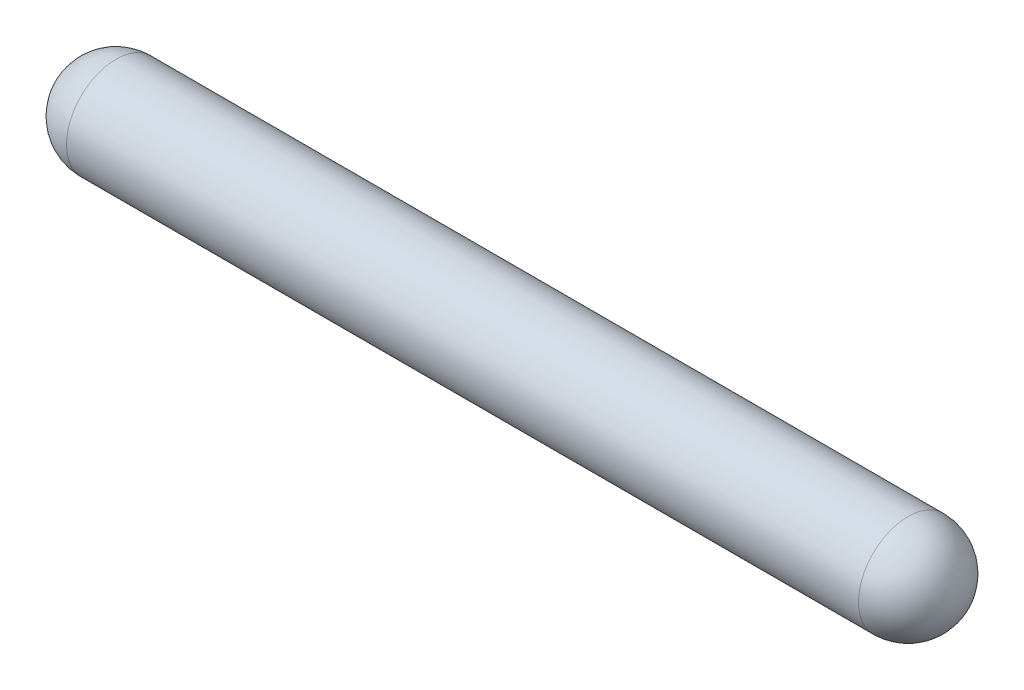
ISO-10303-21;
HEADER;
FILE_DESCRIPTION(('STEP AP214'),'2;1');
FILE_NAME('part.step','',(''),(''),'','','');
FILE_SCHEMA(('AUTOMOTIVE_DESIGN { 1 0 10303 214 1 1 1 1 }'));
ENDSEC;
DATA;
#1=APPLICATION_CONTEXT('core data for automotive mechanical design processes');
#2=APPLICATION_PROTOCOL_DEFINITION('international standard','automotive_design',2000,#1);
#3=PRODUCT_CONTEXT('',#1,'mechanical');
#4=PRODUCT('Part','Part','',(#3));
#5=PRODUCT_RELATED_PRODUCT_CATEGORY('part','',(#4));
#6=PRODUCT_DEFINITION_FORMATION('','',#4);
#7=PRODUCT_DEFINITION_CONTEXT('part definition',#1,'design');
#8=PRODUCT_DEFINITION('design','',#6,#7);
#9=PRODUCT_DEFINITION_SHAPE('','',#8);
#10=(LENGTH_UNIT() NAMED_UNIT(*) SI_UNIT(.MILLI.,.METRE.));
#11=(NAMED_UNIT(*) PLANE_ANGLE_UNIT() SI_UNIT($,.RADIAN.));
#12=(NAMED_UNIT(*) SI_UNIT($,.STERADIAN.) SOLID_ANGLE_UNIT());
#13=UNCERTAINTY_MEASURE_WITH_UNIT(LENGTH_MEASURE(1.E-05),#10,'distance_accuracy_value','');
#14=(GEOMETRIC_REPRESENTATION_CONTEXT(3) GLOBAL_UNCERTAINTY_ASSIGNED_CONTEXT((#13)) GLOBAL_UNIT_ASSIGNED_CONTEXT((#10,
#11,#12)) REPRESENTATION_CONTEXT('',''));
#15=CARTESIAN_POINT('',(0.,0.,0.));
#16=DIRECTION('',(0.,0.,1.));
#17=DIRECTION('',(1.,0.,0.));
#18=AXIS2_PLACEMENT_3D('',#15,#16,#17);
#19=CARTESIAN_POINT('',(20.,32.5,0.));
#20=DIRECTION('',(-1.,0.,0.));
#21=DIRECTION('',(0.,0.,-1.));
#22=AXIS2_PLACEMENT_3D('',#19,#20,#21);
#23=CYLINDRICAL_SURFACE('',#22,2.5);
#24=CARTESIAN_POINT('',(-20.,32.5,0.));
#25=DIRECTION('',(1.,0.,0.));
#26=DIRECTION('',(0.,1.,0.));
#27=AXIS2_PLACEMENT_3D('',#24,#25,#26);
#28=CIRCLE('',#27,2.5);
#29=CARTESIAN_POINT('',(-20.,32.5,-2.5));
#30=VERTEX_POINT('',#29);
#31=CARTESIAN_POINT('',(-20.,32.5,2.5));
#32=VERTEX_POINT('',#31);
#33=EDGE_CURVE('E11',#30,#32,#28,.T.);
#34=ORIENTED_EDGE('',*,*,#33,.T.);
#35=CARTESIAN_POINT('',(-20.,32.5,0.));
#36=DIRECTION('',(-1.,0.,0.));
#37=DIRECTION('',(0.,-1.,0.));
#38=AXIS2_PLACEMENT_3D('',#35,#36,#37);
#39=CIRCLE('',#38,2.5);
#40=EDGE_CURVE('E24',#30,#32,#39,.T.);
#41=ORIENTED_EDGE('',*,*,#40,.F.);
#42=EDGE_LOOP('',(#34,#41));
#43=FACE_BOUND('',#42,.T.);
#44=CARTESIAN_POINT('',(20.,32.5,0.));
#45=DIRECTION('',(1.,0.,0.));
#46=DIRECTION('',(0.,1.,0.));
#47=AXIS2_PLACEMENT_3D('',#44,#45,#46);
#48=CIRCLE('',#47,2.5);
#49=CARTESIAN_POINT('',(20.,32.5,-2.5));
#50=VERTEX_POINT('',#49);
#51=CARTESIAN_POINT('',(20.,32.5,2.5));
#52=VERTEX_POINT('',#51);
#53=EDGE_CURVE('E40',#50,#52,#48,.T.);
#54=ORIENTED_EDGE('',*,*,#53,.F.);
#55=CARTESIAN_POINT('',(20.,32.5,0.));
#56=DIRECTION('',(-1.,0.,0.));
#57=DIRECTION('',(0.,-1.,0.));
#58=AXIS2_PLACEMENT_3D('',#55,#56,#57);
#59=CIRCLE('',#58,2.5);
#60=EDGE_CURVE('E30',#50,#52,#59,.T.);
#61=ORIENTED_EDGE('',*,*,#60,.T.);
#62=EDGE_LOOP('',(#54,#61));
#63=FACE_BOUND('',#62,.T.);
#64=ADVANCED_FACE('F16',(#43,#63),#23,.T.);
#65=CARTESIAN_POINT('',(-20.,32.5,0.));
#66=DIRECTION('',(0.,0.,1.));
#67=DIRECTION('',(0.,1.,0.));
#68=AXIS2_PLACEMENT_3D('',#65,#66,#67);
#69=SPHERICAL_SURFACE('',#68,2.5);
#70=CARTESIAN_POINT('',(-20.,32.5,0.));
#71=DIRECTION('',(1.,0.,0.));
#72=DIRECTION('',(0.,1.,0.));
#73=AXIS2_PLACEMENT_3D('',#70,#71,#72);
#74=SPHERICAL_SURFACE('',#73,2.5);
#75=ORIENTED_EDGE('',*,*,#33,.F.);
#76=ORIENTED_EDGE('',*,*,#40,.T.);
#77=EDGE_LOOP('',(#75,#76));
#78=FACE_BOUND('',#77,.T.);
#79=ADVANCED_FACE('F62',(#78),#74,.T.);
#80=CARTESIAN_POINT('',(20.,32.5,0.));
#81=DIRECTION('',(0.,0.,1.));
#82=DIRECTION('',(0.,-1.,0.));
#83=AXIS2_PLACEMENT_3D('',#80,#81,#82);
#84=SPHERICAL_SURFACE('',#83,2.5);
#85=CARTESIAN_POINT('',(20.,32.5,0.));
#86=DIRECTION('',(-1.,0.,0.));
#87=DIRECTION('',(0.,-1.,0.));
#88=AXIS2_PLACEMENT_3D('',#85,#86,#87);
#89=SPHERICAL_SURFACE('',#88,2.5);
#90=ORIENTED_EDGE('',*,*,#60,.F.);
#91=ORIENTED_EDGE('',*,*,#53,.T.);
#92=EDGE_LOOP('',(#90,#91));
#93=FACE_BOUND('',#92,.T.);
#94=ADVANCED_FACE('F41',(#93),#89,.T.);
#95=CLOSED_SHELL('',(#64,#79,#94));
#96=MANIFOLD_SOLID_BREP('B1',#95);
#97=ADVANCED_BREP_SHAPE_REPRESENTATION('',(#18,#96),#14);
#98=SHAPE_DEFINITION_REPRESENTATION(#9,#97);
ENDSEC;
END-ISO-10303-21;
